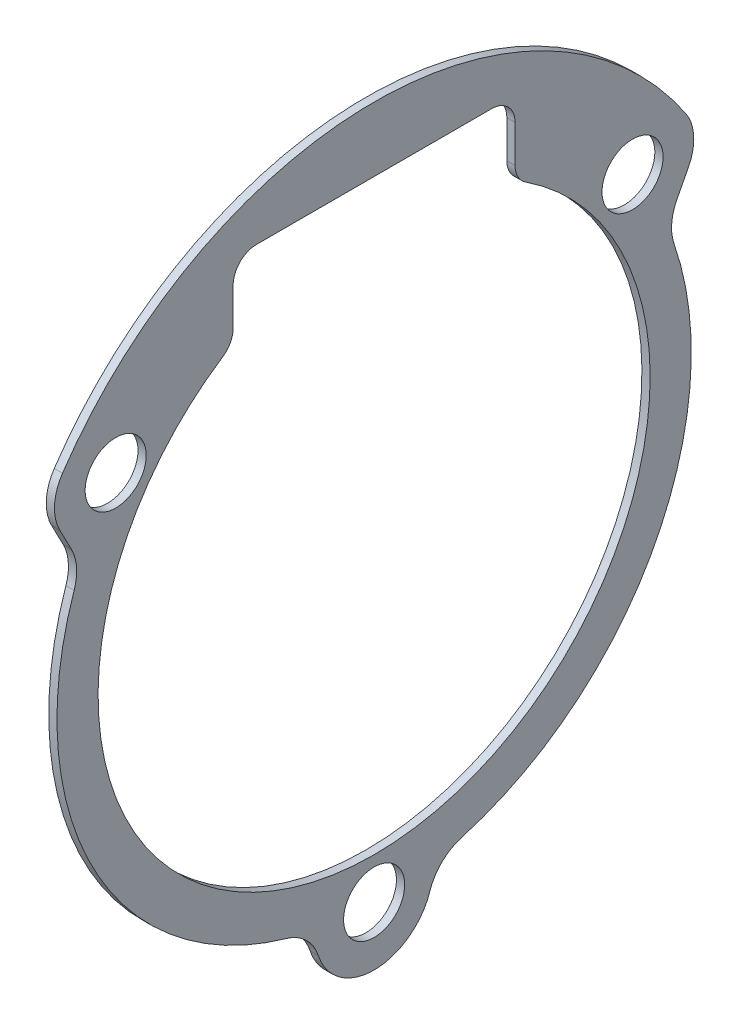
from build123d import *

# Parameters (mm, degrees)
SKETCH1_R      = 1.3
EXTRUDE1_DEPTH = 0.35


with BuildPart() as part:
    # Sketch1 → Extrude1 (new body)
    with BuildSketch(Plane(origin=(0, 0, 0), x_dir=(0, 0, -1), z_dir=(1, 0, 0))):
        with BuildLine():
            Line((-12.885760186, 5.95357069), (-13.381095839, 6.907130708))
            ThreePointArc((-13.381095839, 6.907130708), (-13.603001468, 7.943369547), (-13.264308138, 8.947520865))
            ThreePointArc((-13.264308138, 8.947520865), (0, 16), (13.264308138, 8.947520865))
            ThreePointArc((13.264308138, 8.947520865), (13.603001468, 7.943369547), (13.381095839, 6.907130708))
            Line((13.381095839, 6.907130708), (12.885760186, 5.95357069))
            ThreePointArc((12.885760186, 5.95357069), (12.66609567, 5.17996722), (12.768897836, 4.382379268))
            ThreePointArc((12.768897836, 4.382379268), (11.972673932, -6.2373936), (3.725896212, -12.97565788))
            ThreePointArc((3.725896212, -12.97565788), (2.889265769, -13.458620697), (2.376600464, -14.277386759))
            ThreePointArc((2.376600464, -14.277386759), (0, -16.001648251), (-2.376600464, -14.277386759))
            ThreePointArc((-2.376600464, -14.277386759), (-2.889265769, -13.458620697), (-3.725896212, -12.97565788))
            ThreePointArc((-3.725896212, -12.97565788), (-11.972673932, -6.2373936), (-12.768897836, 4.382379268))
            ThreePointArc((-12.768897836, 4.382379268), (-12.66609567, 5.17996722), (-12.885760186, 5.95357069))
        make_face()
        with Locations((11, 7.829080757)):
            Circle(SKETCH1_R, mode=Mode.SUBTRACT)
        with Locations((-11, 7.829080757)):
            Circle(SKETCH1_R, mode=Mode.SUBTRACT)
        with Locations((0, -13.501648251)):
            Circle(SKETCH1_R, mode=Mode.SUBTRACT)
        with BuildLine():
            Line((-5, 13.25), (5, 13.25))
            ThreePointArc((5, 13.25), (5.707106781, 12.957106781), (6, 12.25))
            Line((6, 12.25), (6, 10.656570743))
            ThreePointArc((6, 10.656570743), (6.119937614, 10.181712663), (6.450980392, 9.820761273))
            ThreePointArc((6.450980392, 9.820761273), (0, -11.75), (-6.450980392, 9.820761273))
            ThreePointArc((-6.450980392, 9.820761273), (-6.119937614, 10.181712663), (-6, 10.656570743))
            Line((-6, 10.656570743), (-6, 12.25))
            ThreePointArc((-6, 12.25), (-5.707106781, 12.957106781), (-5, 13.25))
        make_face(mode=Mode.SUBTRACT)
    extrude(amount=EXTRUDE1_DEPTH)


solid = part.part
